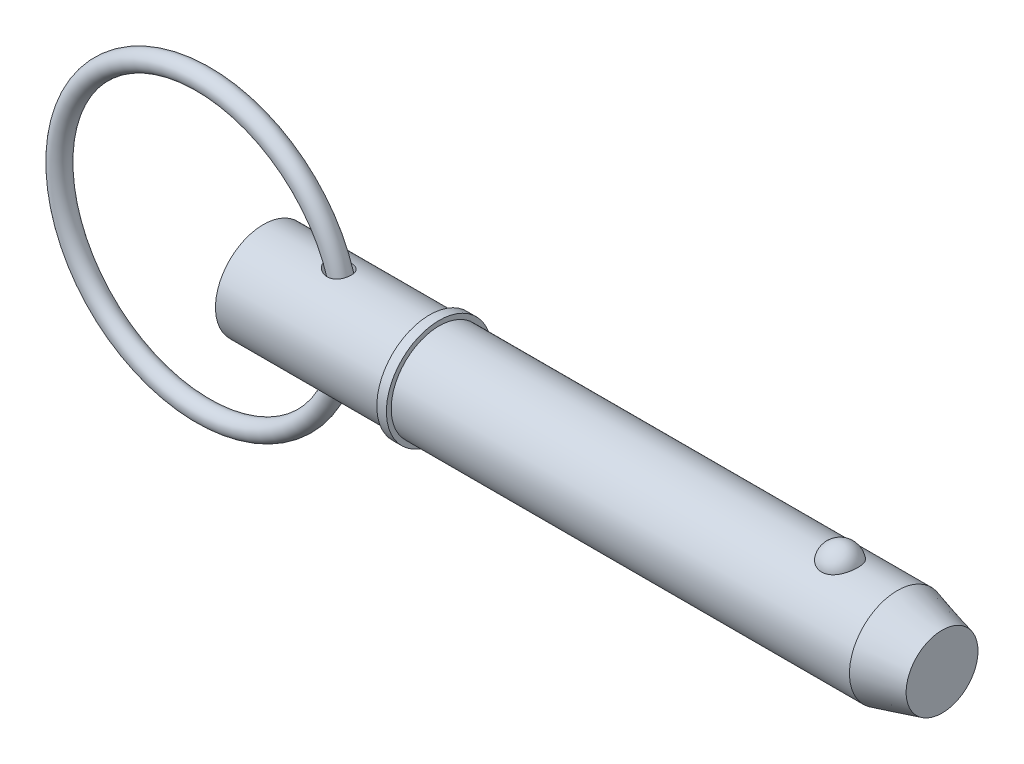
ISO-10303-21;
HEADER;
FILE_DESCRIPTION(('STEP AP214'),'2;1');
FILE_NAME('part.step','',(''),(''),'','','');
FILE_SCHEMA(('AUTOMOTIVE_DESIGN { 1 0 10303 214 1 1 1 1 }'));
ENDSEC;
DATA;
#1=APPLICATION_CONTEXT('core data for automotive mechanical design processes');
#2=APPLICATION_PROTOCOL_DEFINITION('international standard','automotive_design',2000,#1);
#3=PRODUCT_CONTEXT('',#1,'mechanical');
#4=PRODUCT('Part','Part','',(#3));
#5=PRODUCT_RELATED_PRODUCT_CATEGORY('part','',(#4));
#6=PRODUCT_DEFINITION_FORMATION('','',#4);
#7=PRODUCT_DEFINITION_CONTEXT('part definition',#1,'design');
#8=PRODUCT_DEFINITION('design','',#6,#7);
#9=PRODUCT_DEFINITION_SHAPE('','',#8);
#10=(LENGTH_UNIT() NAMED_UNIT(*) SI_UNIT(.MILLI.,.METRE.));
#11=(NAMED_UNIT(*) PLANE_ANGLE_UNIT() SI_UNIT($,.RADIAN.));
#12=(NAMED_UNIT(*) SI_UNIT($,.STERADIAN.) SOLID_ANGLE_UNIT());
#13=UNCERTAINTY_MEASURE_WITH_UNIT(LENGTH_MEASURE(1.E-05),#10,'distance_accuracy_value','');
#14=(GEOMETRIC_REPRESENTATION_CONTEXT(3) GLOBAL_UNCERTAINTY_ASSIGNED_CONTEXT((#13)) GLOBAL_UNIT_ASSIGNED_CONTEXT((#10,
#11,#12)) REPRESENTATION_CONTEXT('',''));
#15=CARTESIAN_POINT('',(0.,0.,0.));
#16=DIRECTION('',(0.,0.,1.));
#17=DIRECTION('',(1.,0.,0.));
#18=AXIS2_PLACEMENT_3D('',#15,#16,#17);
#19=CARTESIAN_POINT('',(-11.9894358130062,0.,0.));
#20=DIRECTION('',(0.,0.,1.));
#21=DIRECTION('',(1.,0.,0.));
#22=AXIS2_PLACEMENT_3D('',#19,#20,#21);
#23=TOROIDAL_SURFACE('',#22,28.575,1.905);
#24=CARTESIAN_POINT('',(18.4905641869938,0.,0.));
#25=VERTEX_POINT('',#24);
#26=VERTEX_LOOP('',#25);
#27=FACE_BOUND('',#26,.T.);
#28=ADVANCED_FACE('P0_F12',(#27),#23,.T.);
#29=CLOSED_SHELL('',(#28));
#30=MANIFOLD_SOLID_BREP('P0_B1',#29);
#31=CARTESIAN_POINT('',(0.,0.,0.));
#32=DIRECTION('',(1.,0.,0.));
#33=DIRECTION('',(0.,0.,-1.));
#34=AXIS2_PLACEMENT_3D('',#31,#32,#33);
#35=CYLINDRICAL_SURFACE('',#34,9.525);
#36=CARTESIAN_POINT('',(12.9513882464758,9.41921920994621,-1.41559473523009));
#37=CARTESIAN_POINT('',(13.0504692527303,9.40163924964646,-1.53256769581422));
#38=CARTESIAN_POINT('',(13.1602600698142,9.38319823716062,-1.6404459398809));
#39=CARTESIAN_POINT('',(13.3966485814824,9.34687220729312,-1.83618480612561));
#40=CARTESIAN_POINT('',(13.5232761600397,9.32898824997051,-1.92400906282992));
#41=CARTESIAN_POINT('',(13.78900694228,9.29593183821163,-2.07784697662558));
#42=CARTESIAN_POINT('',(13.9280753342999,9.28075215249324,-2.14391921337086));
#43=CARTESIAN_POINT('',(14.2153444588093,9.25488828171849,-2.25295850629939));
#44=CARTESIAN_POINT('',(14.3635415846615,9.24420233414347,-2.29593462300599));
#45=CARTESIAN_POINT('',(14.669669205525,9.22859713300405,-2.3579005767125));
#46=CARTESIAN_POINT('',(14.8277567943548,9.22385123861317,-2.37617053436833));
#47=CARTESIAN_POINT('',(15.1447573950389,9.22170813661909,-2.38448481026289));
#48=CARTESIAN_POINT('',(15.3036699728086,9.22430739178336,-2.3745427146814));
#49=CARTESIAN_POINT('',(15.6046561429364,9.2363636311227,-2.32717331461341));
#50=CARTESIAN_POINT('',(15.7470893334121,9.24528216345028,-2.29190131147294));
#51=CARTESIAN_POINT('',(16.0228763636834,9.26842607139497,-2.19642882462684));
#52=CARTESIAN_POINT('',(16.1562346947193,9.28264879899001,-2.1362407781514));
#53=CARTESIAN_POINT('',(16.3991522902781,9.31332263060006,-1.99805318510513));
#54=CARTESIAN_POINT('',(16.5097585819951,9.32951023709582,-1.92182839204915));
#55=CARTESIAN_POINT('',(16.7159974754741,9.36298467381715,-1.75147176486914));
#56=CARTESIAN_POINT('',(16.811631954,9.38027136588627,-1.65734217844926));
#57=CARTESIAN_POINT('',(16.9833240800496,9.41356881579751,-1.45618916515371));
#58=CARTESIAN_POINT('',(17.0597719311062,9.42959946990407,-1.34950141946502));
#59=CARTESIAN_POINT('',(17.1939538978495,9.45905380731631,-1.12462011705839));
#60=CARTESIAN_POINT('',(17.2516877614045,9.4724774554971,-1.00642640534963));
#61=CARTESIAN_POINT('',(17.3474400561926,9.49535683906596,-0.760990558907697));
#62=CARTESIAN_POINT('',(17.3853184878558,9.50478431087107,-0.633691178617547));
#63=CARTESIAN_POINT('',(17.4399027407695,9.51852575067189,-0.374363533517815));
#64=CARTESIAN_POINT('',(17.4566077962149,9.52283953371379,-0.242335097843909));
#65=CARTESIAN_POINT('',(17.4685150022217,9.52590431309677,0.0235692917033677));
#66=CARTESIAN_POINT('',(17.4635842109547,9.52462091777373,0.157451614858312));
#67=CARTESIAN_POINT('',(17.4320243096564,9.5165501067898,0.422467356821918));
#68=CARTESIAN_POINT('',(17.4053947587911,9.50976257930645,0.55360071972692));
#69=CARTESIAN_POINT('',(17.3310009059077,9.49140797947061,0.809490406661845));
#70=CARTESIAN_POINT('',(17.2832204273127,9.47983724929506,0.934241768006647));
#71=CARTESIAN_POINT('',(17.1676219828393,9.453180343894,1.1736825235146));
#72=CARTESIAN_POINT('',(17.0998044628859,9.43809424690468,1.28837214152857));
#73=CARTESIAN_POINT('',(16.9461013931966,9.40614962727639,1.50393386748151));
#74=CARTESIAN_POINT('',(16.8602910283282,9.38929862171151,1.6048606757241));
#75=CARTESIAN_POINT('',(16.6726759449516,9.35566510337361,1.79055313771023));
#76=CARTESIAN_POINT('',(16.5708731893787,9.33888258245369,1.87532077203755));
#77=CARTESIAN_POINT('',(16.3550631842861,9.30741331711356,2.02572386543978));
#78=CARTESIAN_POINT('',(16.2411701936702,9.29270956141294,2.09151983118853));
#79=CARTESIAN_POINT('',(16.0037488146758,9.26681293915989,2.20343355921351));
#80=CARTESIAN_POINT('',(15.8802207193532,9.25561996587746,2.24955191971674));
#81=CARTESIAN_POINT('',(15.6262451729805,9.23779438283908,2.32167613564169));
#82=CARTESIAN_POINT('',(15.4957570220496,9.23119272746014,2.34754561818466));
#83=CARTESIAN_POINT('',(15.2322153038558,9.22318493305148,2.37881082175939));
#84=CARTESIAN_POINT('',(15.0991611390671,9.22178001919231,2.38420171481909));
#85=CARTESIAN_POINT('',(14.8267609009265,9.22414647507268,2.37503099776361));
#86=CARTESIAN_POINT('',(14.6874545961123,9.22819578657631,2.35939810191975));
#87=CARTESIAN_POINT('',(14.412976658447,9.24129253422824,2.30756034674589));
#88=CARTESIAN_POINT('',(14.2778066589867,9.25034191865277,2.27134746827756));
#89=CARTESIAN_POINT('',(14.0027915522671,9.27334688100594,2.1756145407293));
#90=CARTESIAN_POINT('',(13.8635960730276,9.28766658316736,2.11431132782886));
#91=CARTESIAN_POINT('',(13.5969045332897,9.31925368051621,1.97041856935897));
#92=CARTESIAN_POINT('',(13.4694182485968,9.33652350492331,1.88781145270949));
#93=CARTESIAN_POINT('',(13.2243568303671,9.37286659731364,1.69844580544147));
#94=CARTESIAN_POINT('',(13.1075060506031,9.39198626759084,1.59075211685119));
#95=CARTESIAN_POINT('',(12.8957171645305,9.42881110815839,1.35544651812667));
#96=CARTESIAN_POINT('',(12.8007455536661,9.44651841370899,1.22786557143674));
#97=CARTESIAN_POINT('',(12.6580495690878,9.4741137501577,0.9887243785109));
#98=CARTESIAN_POINT('',(12.604453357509,9.4848570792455,0.880756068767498));
#99=CARTESIAN_POINT('',(12.515693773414,9.50295777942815,0.657225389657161));
#100=CARTESIAN_POINT('',(12.4805142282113,9.51031812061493,0.541669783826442));
#101=CARTESIAN_POINT('',(12.4305797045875,9.52083647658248,0.305475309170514));
#102=CARTESIAN_POINT('',(12.4159122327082,9.52397648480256,0.18481691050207));
#103=CARTESIAN_POINT('',(12.408320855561,9.52559626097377,-0.0572308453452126));
#104=CARTESIAN_POINT('',(12.4153963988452,9.52407614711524,-0.178620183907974));
#105=CARTESIAN_POINT('',(12.4495068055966,9.51684301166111,-0.409566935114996));
#106=CARTESIAN_POINT('',(12.4750931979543,9.51143444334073,-0.519353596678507));
#107=CARTESIAN_POINT('',(12.543120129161,9.49733710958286,-0.73328523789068));
#108=CARTESIAN_POINT('',(12.5855568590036,9.4886490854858,-0.837431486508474));
#109=CARTESIAN_POINT('',(12.6780792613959,9.47023833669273,-1.02356028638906));
#110=CARTESIAN_POINT('',(12.7261842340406,9.46084463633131,-1.10657511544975));
#111=CARTESIAN_POINT('',(12.8319313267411,9.44081892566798,-1.26610577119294));
#112=CARTESIAN_POINT('',(12.8895756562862,9.43018662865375,-1.34262008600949));
#113=CARTESIAN_POINT('',(12.9513882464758,9.41921920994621,-1.41559473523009));
#114=B_SPLINE_CURVE_WITH_KNOTS('',3,(#36,#37,#38,#39,#40,#41,#42,#43,#44,#45,#46,#47,#48,#49,
#50,#51,#52,#53,#54,#55,#56,#57,#58,#59,#60,#61,#62,#63,#64,#65,#66,#67,#68,#69,#70,#71,#72,#73,
#74,#75,#76,#77,#78,#79,#80,#81,#82,#83,#84,#85,#86,#87,#88,#89,#90,#91,#92,#93,#94,#95,#96,#97,
#98,#99,#100,#101,#102,#103,#104,#105,#106,#107,#108,#109,#110,#111,#112,#113),.UNSPECIFIED.,
.T.,.F.,(4,2,2,2,2,2,2,2,2,2,2,2,2,2,2,2,2,2,2,2,2,2,2,2,2,2,2,2,2,2,2,2,2,2,2,2,2,2,4),(0.,
0.462524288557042,0.925880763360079,1.3879789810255,1.8498957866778,2.3250010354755,
2.79987752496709,3.23851602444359,3.67693583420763,4.08084875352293,4.48471100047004,
4.87953549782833,5.27436531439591,5.67194282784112,6.0695347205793,6.46957303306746,
6.86961947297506,7.26997240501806,7.67031642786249,8.06901977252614,8.46767421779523,
8.86284969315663,9.25801315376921,9.65581560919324,10.0537118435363,10.4726706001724,
10.8917927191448,11.3481090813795,11.8048030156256,12.2824769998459,12.7594145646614,
13.1209614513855,13.4821903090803,13.8449555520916,14.2077115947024,14.5447865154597,
14.881785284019,15.170268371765,15.4588183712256),.UNSPECIFIED.);
#115=CARTESIAN_POINT('',(12.9513882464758,9.41921920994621,-1.41559473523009));
#116=VERTEX_POINT('',#115);
#117=EDGE_CURVE('P1_E42',#116,#116,#114,.T.);
#118=ORIENTED_EDGE('',*,*,#117,.T.);
#119=EDGE_LOOP('',(#118));
#120=FACE_BOUND('',#119,.T.);
#121=CARTESIAN_POINT('',(0.,0.,0.));
#122=DIRECTION('',(1.,0.,0.));
#123=DIRECTION('',(0.,0.,-1.));
#124=AXIS2_PLACEMENT_3D('',#121,#122,#123);
#125=CIRCLE('',#124,9.525);
#126=CARTESIAN_POINT('',(0.,0.,-9.525));
#127=VERTEX_POINT('',#126);
#128=EDGE_CURVE('P1_E9',#127,#127,#125,.T.);
#129=ORIENTED_EDGE('',*,*,#128,.T.);
#130=EDGE_LOOP('',(#129));
#131=FACE_BOUND('',#130,.T.);
#132=CARTESIAN_POINT('',(33.025,0.,0.));
#133=DIRECTION('',(1.,0.,0.));
#134=DIRECTION('',(0.,0.,-1.));
#135=AXIS2_PLACEMENT_3D('',#132,#133,#134);
#136=CIRCLE('',#135,9.525);
#137=CARTESIAN_POINT('',(33.025,0.,-9.525));
#138=VERTEX_POINT('',#137);
#139=EDGE_CURVE('P1_E25',#138,#138,#136,.T.);
#140=ORIENTED_EDGE('',*,*,#139,.F.);
#141=EDGE_LOOP('',(#140));
#142=FACE_BOUND('',#141,.T.);
#143=CARTESIAN_POINT('',(12.9513882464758,-9.41921920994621,-1.41559473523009));
#144=CARTESIAN_POINT('',(12.8706569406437,-9.43354320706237,-1.32028288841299));
#145=CARTESIAN_POINT('',(12.7970077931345,-9.44729974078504,-1.21890449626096));
#146=CARTESIAN_POINT('',(12.6667099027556,-9.47239055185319,-1.00546491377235));
#147=CARTESIAN_POINT('',(12.6100480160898,-9.48372669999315,-0.893412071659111));
#148=CARTESIAN_POINT('',(12.5163428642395,-9.50281544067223,-0.66020233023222));
#149=CARTESIAN_POINT('',(12.4794216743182,-9.51054569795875,-0.538993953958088));
#150=CARTESIAN_POINT('',(12.4282252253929,-9.52133525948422,-0.29167282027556));
#151=CARTESIAN_POINT('',(12.4139371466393,-9.52439720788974,-0.165562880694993));
#152=CARTESIAN_POINT('',(12.4092595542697,-9.52539668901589,0.0763263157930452));
#153=CARTESIAN_POINT('',(12.4169377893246,-9.5237485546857,0.192070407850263));
#154=CARTESIAN_POINT('',(12.4515961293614,-9.51640070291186,0.420478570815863));
#155=CARTESIAN_POINT('',(12.4785770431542,-9.51070081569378,0.533142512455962));
#156=CARTESIAN_POINT('',(12.5496371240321,-9.49599978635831,0.750537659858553));
#157=CARTESIAN_POINT('',(12.5934215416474,-9.48705569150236,0.855370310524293));
#158=CARTESIAN_POINT('',(12.6960201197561,-9.46670226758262,1.05710432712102));
#159=CARTESIAN_POINT('',(12.754838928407,-9.45529217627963,1.15400322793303));
#160=CARTESIAN_POINT('',(12.8926588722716,-9.42958102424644,1.34883014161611));
#161=CARTESIAN_POINT('',(12.9731843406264,-9.41509922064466,1.44565277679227));
#162=CARTESIAN_POINT('',(13.1473692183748,-9.38554264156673,1.62653953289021));
#163=CARTESIAN_POINT('',(13.2410364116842,-9.37046751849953,1.71059603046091));
#164=CARTESIAN_POINT('',(13.4543924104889,-9.33867330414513,1.87697964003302));
#165=CARTESIAN_POINT('',(13.5758667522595,-9.32205896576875,1.95704323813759));
#166=CARTESIAN_POINT('',(13.8299208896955,-9.29140277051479,2.09777392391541));
#167=CARTESIAN_POINT('',(13.9625074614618,-9.27736250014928,2.15842906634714));
#168=CARTESIAN_POINT('',(14.2477938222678,-9.25234849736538,2.26337318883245));
#169=CARTESIAN_POINT('',(14.4012368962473,-9.2417532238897,2.30575283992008));
#170=CARTESIAN_POINT('',(14.7134258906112,-9.22706044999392,2.36387471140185));
#171=CARTESIAN_POINT('',(14.8721705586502,-9.22296142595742,2.37962317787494));
#172=CARTESIAN_POINT('',(15.1841930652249,-9.22219798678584,2.38258156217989));
#173=CARTESIAN_POINT('',(15.3374581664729,-9.22526675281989,2.37081567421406));
#174=CARTESIAN_POINT('',(15.6390558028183,-9.23821642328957,2.31984408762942));
#175=CARTESIAN_POINT('',(15.7873916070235,-9.24809271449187,2.28065697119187));
#176=CARTESIAN_POINT('',(16.0605055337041,-9.27231045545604,2.17997072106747));
#177=CARTESIAN_POINT('',(16.1861988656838,-9.28616347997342,2.12082794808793));
#178=CARTESIAN_POINT('',(16.4248737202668,-9.31689725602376,1.9814435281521));
#179=CARTESIAN_POINT('',(16.5378583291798,-9.33377726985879,1.90120701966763));
#180=CARTESIAN_POINT('',(16.7424913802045,-9.36766057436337,1.72629138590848));
#181=CARTESIAN_POINT('',(16.8349077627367,-9.38461836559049,1.63249912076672));
#182=CARTESIAN_POINT('',(17.0025959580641,-9.41752009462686,1.43052052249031));
#183=CARTESIAN_POINT('',(17.0778684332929,-9.43346407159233,1.32233474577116));
#184=CARTESIAN_POINT('',(17.2093311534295,-9.46256896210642,1.09477833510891));
#185=CARTESIAN_POINT('',(17.2655443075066,-9.47573320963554,0.975421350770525));
#186=CARTESIAN_POINT('',(17.3577240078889,-9.49788660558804,0.728764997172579));
#187=CARTESIAN_POINT('',(17.3936897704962,-9.5068755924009,0.601465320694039));
#188=CARTESIAN_POINT('',(17.4447894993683,-9.51977728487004,0.341392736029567));
#189=CARTESIAN_POINT('',(17.4597470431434,-9.52364698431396,0.208583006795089));
#190=CARTESIAN_POINT('',(17.467935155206,-9.52575588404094,-0.0577507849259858));
#191=CARTESIAN_POINT('',(17.4611651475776,-9.52399493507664,-0.191274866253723));
#192=CARTESIAN_POINT('',(17.4259933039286,-9.51501704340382,-0.455658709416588));
#193=CARTESIAN_POINT('',(17.3975278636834,-9.50778405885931,-0.586509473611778));
#194=CARTESIAN_POINT('',(17.3195245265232,-9.48862442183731,-0.841413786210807));
#195=CARTESIAN_POINT('',(17.2699864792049,-9.47669773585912,-0.965467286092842));
#196=CARTESIAN_POINT('',(17.1510794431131,-9.44947793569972,-1.20302860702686));
#197=CARTESIAN_POINT('',(17.0817421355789,-9.43419020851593,-1.31655289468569));
#198=CARTESIAN_POINT('',(16.9249035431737,-9.40193593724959,-1.52999797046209));
#199=CARTESIAN_POINT('',(16.8374037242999,-9.38496952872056,-1.62991985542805));
#200=CARTESIAN_POINT('',(16.6472525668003,-9.35139745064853,-1.81261591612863));
#201=CARTESIAN_POINT('',(16.544718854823,-9.33479003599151,-1.89551219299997));
#202=CARTESIAN_POINT('',(16.3268885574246,-9.30366076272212,-2.04284430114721));
#203=CARTESIAN_POINT('',(16.2115933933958,-9.28913867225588,-2.10728218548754));
#204=CARTESIAN_POINT('',(15.9721327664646,-9.26380878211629,-2.21598517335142));
#205=CARTESIAN_POINT('',(15.8480095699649,-9.25298455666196,-2.26033977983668));
#206=CARTESIAN_POINT('',(15.5939970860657,-9.23601616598,-2.32870721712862));
#207=CARTESIAN_POINT('',(15.4641070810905,-9.22987258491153,-2.35271750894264));
#208=CARTESIAN_POINT('',(15.1982340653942,-9.22261892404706,-2.38099747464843));
#209=CARTESIAN_POINT('',(15.0621840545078,-9.22166165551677,-2.38466791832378));
#210=CARTESIAN_POINT('',(14.7911713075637,-9.22504733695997,-2.37153091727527));
#211=CARTESIAN_POINT('',(14.6562088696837,-9.2293916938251,-2.35471803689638));
#212=CARTESIAN_POINT('',(14.3799999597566,-9.24325361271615,-2.29972931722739));
#213=CARTESIAN_POINT('',(14.2390842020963,-9.25314817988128,-2.2599897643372));
#214=CARTESIAN_POINT('',(13.9651910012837,-9.27709186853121,-2.15959208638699));
#215=CARTESIAN_POINT('',(13.8322212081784,-9.29114491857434,-2.09891417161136));
#216=CARTESIAN_POINT('',(13.5621642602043,-9.32369066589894,-1.94960068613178));
#217=CARTESIAN_POINT('',(13.4264724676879,-9.34251276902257,-1.85849626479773));
#218=CARTESIAN_POINT('',(13.1736579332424,-9.38095091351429,-1.6535412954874));
#219=CARTESIAN_POINT('',(13.0565182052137,-9.40056620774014,-1.53971177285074));
#220=CARTESIAN_POINT('',(12.9513882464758,-9.41921920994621,-1.41559473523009));
#221=B_SPLINE_CURVE_WITH_KNOTS('',3,(#143,#144,#145,#146,#147,#148,#149,#150,#151,#152,#153,
#154,#155,#156,#157,#158,#159,#160,#161,#162,#163,#164,#165,#166,#167,#168,#169,#170,#171,#172,
#173,#174,#175,#176,#177,#178,#179,#180,#181,#182,#183,#184,#185,#186,#187,#188,#189,#190,#191,
#192,#193,#194,#195,#196,#197,#198,#199,#200,#201,#202,#203,#204,#205,#206,#207,#208,#209,#210,
#211,#212,#213,#214,#215,#216,#217,#218,#219,#220),.UNSPECIFIED.,.T.,.F.,(4,2,2,2,2,2,2,2,2,2,2,
2,2,2,2,2,2,2,2,2,2,2,2,2,2,2,2,2,2,2,2,2,2,2,2,2,2,2,4),(0.,0.376746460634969,0.75320065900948,
1.13195666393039,1.51049805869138,1.85679105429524,2.20309856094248,2.54359033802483,
2.88418751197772,3.26301611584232,3.64207005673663,4.07954912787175,4.51729693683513,
4.99355673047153,5.46970480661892,5.92841231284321,6.38680927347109,6.80346940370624,
7.22002812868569,7.61642768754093,8.01281192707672,8.40871801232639,8.80463942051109,
9.20386620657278,9.60310357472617,10.0035159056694,10.4039310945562,10.8037091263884,
11.2034549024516,11.6002252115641,11.9969513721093,12.3918916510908,12.7868812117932,
13.1934480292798,13.6001227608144,14.038511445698,14.4773156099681,14.9683748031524,
15.4589817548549),.UNSPECIFIED.);
#222=CARTESIAN_POINT('',(12.9513882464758,-9.41921920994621,-1.41559473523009));
#223=VERTEX_POINT('',#222);
#224=EDGE_CURVE('P1_E17',#223,#223,#221,.T.);
#225=ORIENTED_EDGE('',*,*,#224,.T.);
#226=EDGE_LOOP('',(#225));
#227=FACE_BOUND('',#226,.T.);
#228=ADVANCED_FACE('P1_F13',(#120,#131,#142,#227),#35,.T.);
#229=CARTESIAN_POINT('',(0.,0.,0.));
#230=DIRECTION('',(1.,0.,0.));
#231=DIRECTION('',(0.,0.,-1.));
#232=AXIS2_PLACEMENT_3D('',#229,#230,#231);
#233=CYLINDRICAL_SURFACE('',#232,9.525);
#234=CARTESIAN_POINT('',(126.043054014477,0.,0.));
#235=DIRECTION('',(1.,0.,0.));
#236=DIRECTION('',(0.,0.,-1.));
#237=AXIS2_PLACEMENT_3D('',#234,#235,#236);
#238=CIRCLE('',#237,9.525);
#239=CARTESIAN_POINT('',(126.043054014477,0.,-9.525));
#240=VERTEX_POINT('',#239);
#241=EDGE_CURVE('P1_E99',#240,#240,#238,.T.);
#242=ORIENTED_EDGE('',*,*,#241,.F.);
#243=EDGE_LOOP('',(#242));
#244=FACE_BOUND('',#243,.T.);
#245=CARTESIAN_POINT('',(34.93,0.,0.));
#246=DIRECTION('',(1.,0.,0.));
#247=DIRECTION('',(0.,0.,-1.));
#248=AXIS2_PLACEMENT_3D('',#245,#246,#247);
#249=CIRCLE('',#248,9.525);
#250=CARTESIAN_POINT('',(34.93,0.,-9.525));
#251=VERTEX_POINT('',#250);
#252=EDGE_CURVE('P1_E96',#251,#251,#249,.T.);
#253=ORIENTED_EDGE('',*,*,#252,.T.);
#254=EDGE_LOOP('',(#253));
#255=FACE_BOUND('',#254,.T.);
#256=CARTESIAN_POINT('',(114.645757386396,8.80405803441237,3.63513233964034));
#257=CARTESIAN_POINT('',(114.551676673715,8.80405953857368,3.63513053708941));
#258=CARTESIAN_POINT('',(114.457561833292,8.80561325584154,3.63137461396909));
#259=CARTESIAN_POINT('',(114.270012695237,8.81177748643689,3.61638665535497));
#260=CARTESIAN_POINT('',(114.176578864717,8.81638992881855,3.60514990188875));
#261=CARTESIAN_POINT('',(113.897945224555,8.83467114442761,3.56024627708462));
#262=CARTESIAN_POINT('',(113.714691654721,8.85278327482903,3.5153862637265));
#263=CARTESIAN_POINT('',(113.359509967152,8.89871214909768,3.39742145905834));
#264=CARTESIAN_POINT('',(113.187553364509,8.92650327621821,3.32439116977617));
#265=CARTESIAN_POINT('',(112.858707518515,8.98874819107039,3.15220244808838));
#266=CARTESIAN_POINT('',(112.701811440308,9.02319893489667,3.05305594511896));
#267=CARTESIAN_POINT('',(112.402214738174,9.09629186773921,2.82797815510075));
#268=CARTESIAN_POINT('',(112.260060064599,9.13502685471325,2.70135138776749));
#269=CARTESIAN_POINT('',(111.998299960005,9.2118657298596,2.42641932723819));
#270=CARTESIAN_POINT('',(111.878701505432,9.2499694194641,2.27810735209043));
#271=CARTESIAN_POINT('',(111.659645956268,9.32341082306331,1.95652290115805));
#272=CARTESIAN_POINT('',(111.561317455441,9.35855090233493,1.78243511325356));
#273=CARTESIAN_POINT('',(111.393819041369,9.42045142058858,1.41937246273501));
#274=CARTESIAN_POINT('',(111.324651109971,9.44721128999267,1.23039658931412));
#275=CARTESIAN_POINT('',(111.216199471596,9.48990641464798,0.84037088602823));
#276=CARTESIAN_POINT('',(111.177288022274,9.50570658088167,0.639202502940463));
#277=CARTESIAN_POINT('',(111.131555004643,9.52433146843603,0.23266436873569));
#278=CARTESIAN_POINT('',(111.124732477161,9.52715657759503,0.0272947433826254));
#279=CARTESIAN_POINT('',(111.143255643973,9.51956918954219,-0.380478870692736));
#280=CARTESIAN_POINT('',(111.168405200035,9.50923740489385,-0.582893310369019));
#281=CARTESIAN_POINT('',(111.25002537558,9.47651897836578,-0.980293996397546));
#282=CARTESIAN_POINT('',(111.306496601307,9.45413210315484,-1.17528009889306));
#283=CARTESIAN_POINT('',(111.449719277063,9.39954044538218,-1.55263697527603));
#284=CARTESIAN_POINT('',(111.536512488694,9.36732213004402,-1.73498993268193));
#285=CARTESIAN_POINT('',(111.738610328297,9.29640700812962,-2.08177763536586));
#286=CARTESIAN_POINT('',(111.853917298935,9.25770966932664,-2.24621090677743));
#287=CARTESIAN_POINT('',(112.111264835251,9.17775604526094,-2.5533833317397));
#288=CARTESIAN_POINT('',(112.253434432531,9.136488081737,-2.696011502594));
#289=CARTESIAN_POINT('',(112.56089985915,9.05620497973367,-2.95451229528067));
#290=CARTESIAN_POINT('',(112.726193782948,9.01718965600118,-3.070387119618));
#291=CARTESIAN_POINT('',(113.072052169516,8.94680019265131,-3.26976836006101));
#292=CARTESIAN_POINT('',(113.252227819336,8.91528408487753,-3.353897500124));
#293=CARTESIAN_POINT('',(113.625651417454,8.86272514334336,-3.49043503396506));
#294=CARTESIAN_POINT('',(113.818894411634,8.84167836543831,-3.54285537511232));
#295=CARTESIAN_POINT('',(114.202503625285,8.81348056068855,-3.61241306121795));
#296=CARTESIAN_POINT('',(114.392525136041,8.80568348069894,-3.63119339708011));
#297=CARTESIAN_POINT('',(114.773190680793,8.80289410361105,-3.63795342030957));
#298=CARTESIAN_POINT('',(114.963834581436,8.80789922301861,-3.62593932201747));
#299=CARTESIAN_POINT('',(115.334007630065,8.82974915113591,-3.57238430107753));
#300=CARTESIAN_POINT('',(115.513697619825,8.84621463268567,-3.53178890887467));
#301=CARTESIAN_POINT('',(115.863422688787,8.88875330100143,-3.42331083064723));
#302=CARTESIAN_POINT('',(116.033456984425,8.91482726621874,-3.35542593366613));
#303=CARTESIAN_POINT('',(116.363237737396,8.97448239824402,-3.19248225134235));
#304=CARTESIAN_POINT('',(116.522680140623,9.00821446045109,-3.0968647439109));
#305=CARTESIAN_POINT('',(116.823513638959,9.07935398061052,-2.88162736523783));
#306=CARTESIAN_POINT('',(116.964900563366,9.11676228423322,-2.76200196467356));
#307=CARTESIAN_POINT('',(117.23331931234,9.19347419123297,-2.49516285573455));
#308=CARTESIAN_POINT('',(117.359275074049,9.23277872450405,-2.34686614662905));
#309=CARTESIAN_POINT('',(117.585522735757,9.3073761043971,-2.0309368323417));
#310=CARTESIAN_POINT('',(117.68581004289,9.34266823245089,-1.86330077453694));
#311=CARTESIAN_POINT('',(117.861514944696,9.40674710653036,-1.50744893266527));
#312=CARTESIAN_POINT('',(117.936041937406,9.43529176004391,-1.31874876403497));
#313=CARTESIAN_POINT('',(118.05416505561,9.48144132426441,-0.930631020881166));
#314=CARTESIAN_POINT('',(118.097760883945,9.49904612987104,-0.73121334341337));
#315=CARTESIAN_POINT('',(118.153158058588,9.5215314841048,-0.327147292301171));
#316=CARTESIAN_POINT('',(118.164935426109,9.52640243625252,-0.12249509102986));
#317=CARTESIAN_POINT('',(118.156382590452,9.5228957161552,0.286018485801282));
#318=CARTESIAN_POINT('',(118.13605305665,9.5145183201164,0.489879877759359));
#319=CARTESIAN_POINT('',(118.063884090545,9.48544083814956,0.889994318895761));
#320=CARTESIAN_POINT('',(118.012199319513,9.46480124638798,1.08627971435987));
#321=CARTESIAN_POINT('',(117.878491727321,9.41333895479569,1.46682086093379));
#322=CARTESIAN_POINT('',(117.796466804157,9.38251554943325,1.65107577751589));
#323=CARTESIAN_POINT('',(117.60319292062,9.31365636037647,2.00346348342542));
#324=CARTESIAN_POINT('',(117.491783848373,9.27558138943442,2.17150083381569));
#325=CARTESIAN_POINT('',(117.242294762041,9.19638714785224,2.48563115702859));
#326=CARTESIAN_POINT('',(117.104216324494,9.15526805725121,2.63172542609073));
#327=CARTESIAN_POINT('',(116.804843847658,9.07465393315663,2.89750997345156));
#328=CARTESIAN_POINT('',(116.643610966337,9.03515496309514,3.01726776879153));
#329=CARTESIAN_POINT('',(116.301613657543,8.96227564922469,3.22732920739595));
#330=CARTESIAN_POINT('',(116.120841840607,8.92889763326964,3.31762165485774));
#331=CARTESIAN_POINT('',(115.751445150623,8.8734538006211,3.46314419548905));
#332=CARTESIAN_POINT('',(115.56332371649,8.85102983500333,3.51950082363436));
#333=CARTESIAN_POINT('',(115.27578699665,8.8266696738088,3.57993683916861));
#334=CARTESIAN_POINT('',(115.179133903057,8.82009725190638,3.5960621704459));
#335=CARTESIAN_POINT('',(114.984677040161,8.81020897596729,3.62022512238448));
#336=CARTESIAN_POINT('',(114.88687410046,8.80689090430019,3.62826825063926));
#337=CARTESIAN_POINT('',(114.741224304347,8.80445615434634,3.63416760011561));
#338=CARTESIAN_POINT('',(114.693495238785,8.80405727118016,3.63513325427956));
#339=CARTESIAN_POINT('',(114.645757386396,8.80405803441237,3.63513233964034));
#340=B_SPLINE_CURVE_WITH_KNOTS('',3,(#256,#257,#258,#259,#260,#261,#262,#263,#264,#265,#266,
#267,#268,#269,#270,#271,#272,#273,#274,#275,#276,#277,#278,#279,#280,#281,#282,#283,#284,#285,
#286,#287,#288,#289,#290,#291,#292,#293,#294,#295,#296,#297,#298,#299,#300,#301,#302,#303,#304,
#305,#306,#307,#308,#309,#310,#311,#312,#313,#314,#315,#316,#317,#318,#319,#320,#321,#322,#323,
#324,#325,#326,#327,#328,#329,#330,#331,#332,#333,#334,#335,#336,#337,#338,#339),.UNSPECIFIED.,
.T.,.F.,(4,2,2,2,2,2,2,2,2,2,2,2,2,2,2,2,2,2,2,2,2,2,2,2,2,2,2,2,2,2,2,2,2,2,2,2,2,2,2,2,2,4),
(0.,0.282202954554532,0.564584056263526,1.13017050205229,1.69427128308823,2.25811483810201,
2.83836627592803,3.4187968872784,4.02497117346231,4.63118665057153,5.24474754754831,
5.85829010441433,6.46808687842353,7.07789545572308,7.68854723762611,8.29924920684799,
8.9129628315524,9.52662591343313,10.1275338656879,10.7282152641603,11.2986646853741,
11.8689989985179,12.4213015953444,12.973648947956,13.5380053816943,14.1024919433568,
14.695298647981,15.2882113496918,15.8999469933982,16.5116885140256,17.1238909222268,
17.7360805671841,18.3452748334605,18.9545113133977,19.567138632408,20.179729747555,
20.7907316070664,21.4019653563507,21.9915938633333,22.2859053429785,22.5800161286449,
22.7232098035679),.UNSPECIFIED.);
#341=CARTESIAN_POINT('',(114.645757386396,8.80405803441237,3.63513233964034));
#342=VERTEX_POINT('',#341);
#343=EDGE_CURVE('P1_E34',#342,#342,#340,.T.);
#344=ORIENTED_EDGE('',*,*,#343,.T.);
#345=EDGE_LOOP('',(#344));
#346=FACE_BOUND('',#345,.T.);
#347=ADVANCED_FACE('P1_F46',(#244,#255,#346),#233,.T.);
#348=CARTESIAN_POINT('',(0.,0.,0.));
#349=DIRECTION('',(-1.,0.,0.));
#350=DIRECTION('',(0.,0.,1.));
#351=AXIS2_PLACEMENT_3D('',#348,#349,#350);
#352=PLANE('',#351);
#353=ORIENTED_EDGE('',*,*,#128,.F.);
#354=EDGE_LOOP('',(#353));
#355=FACE_BOUND('',#354,.T.);
#356=ADVANCED_FACE('P1_F15',(#355),#352,.T.);
#357=CARTESIAN_POINT('',(33.025,9.525,0.));
#358=DIRECTION('',(-1.,0.,0.));
#359=DIRECTION('',(0.,0.,1.));
#360=AXIS2_PLACEMENT_3D('',#357,#358,#359);
#361=PLANE('',#360);
#362=ORIENTED_EDGE('',*,*,#139,.T.);
#363=EDGE_LOOP('',(#362));
#364=FACE_BOUND('',#363,.T.);
#365=CARTESIAN_POINT('',(33.025,0.,0.));
#366=DIRECTION('',(1.,0.,0.));
#367=DIRECTION('',(0.,0.,-1.));
#368=AXIS2_PLACEMENT_3D('',#365,#366,#367);
#369=CIRCLE('',#368,10.4775);
#370=CARTESIAN_POINT('',(33.025,0.,-10.4775));
#371=VERTEX_POINT('',#370);
#372=EDGE_CURVE('P1_E30',#371,#371,#369,.T.);
#373=ORIENTED_EDGE('',*,*,#372,.F.);
#374=EDGE_LOOP('',(#373));
#375=FACE_BOUND('',#374,.T.);
#376=ADVANCED_FACE('P1_F81',(#364,#375),#361,.T.);
#377=CARTESIAN_POINT('',(0.,0.,0.));
#378=DIRECTION('',(1.,0.,0.));
#379=DIRECTION('',(0.,0.,-1.));
#380=AXIS2_PLACEMENT_3D('',#377,#378,#379);
#381=CYLINDRICAL_SURFACE('',#380,10.4775);
#382=ORIENTED_EDGE('',*,*,#372,.T.);
#383=EDGE_LOOP('',(#382));
#384=FACE_BOUND('',#383,.T.);
#385=CARTESIAN_POINT('',(34.93,0.,0.));
#386=DIRECTION('',(1.,0.,0.));
#387=DIRECTION('',(0.,0.,-1.));
#388=AXIS2_PLACEMENT_3D('',#385,#386,#387);
#389=CIRCLE('',#388,10.4775);
#390=CARTESIAN_POINT('',(34.93,0.,-10.4775));
#391=VERTEX_POINT('',#390);
#392=EDGE_CURVE('P1_E95',#391,#391,#389,.T.);
#393=ORIENTED_EDGE('',*,*,#392,.F.);
#394=EDGE_LOOP('',(#393));
#395=FACE_BOUND('',#394,.T.);
#396=ADVANCED_FACE('P1_F68',(#384,#395),#381,.T.);
#397=CARTESIAN_POINT('',(34.93,10.4775,0.));
#398=DIRECTION('',(1.,0.,0.));
#399=DIRECTION('',(0.,0.,-1.));
#400=AXIS2_PLACEMENT_3D('',#397,#398,#399);
#401=PLANE('',#400);
#402=ORIENTED_EDGE('',*,*,#392,.T.);
#403=EDGE_LOOP('',(#402));
#404=FACE_BOUND('',#403,.T.);
#405=ORIENTED_EDGE('',*,*,#252,.F.);
#406=EDGE_LOOP('',(#405));
#407=FACE_BOUND('',#406,.T.);
#408=ADVANCED_FACE('P1_F62',(#404,#407),#401,.T.);
#409=CARTESIAN_POINT('',(134.93,0.,0.));
#410=DIRECTION('',(-1.,0.,0.));
#411=DIRECTION('',(0.,0.,1.));
#412=AXIS2_PLACEMENT_3D('',#409,#410,#411);
#413=CONICAL_SURFACE('',#412,7.14375000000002,0.26179938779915);
#414=ORIENTED_EDGE('',*,*,#241,.T.);
#415=EDGE_LOOP('',(#414));
#416=FACE_BOUND('',#415,.T.);
#417=CARTESIAN_POINT('',(134.93,0.,0.));
#418=DIRECTION('',(1.,0.,0.));
#419=DIRECTION('',(0.,0.,-1.));
#420=AXIS2_PLACEMENT_3D('',#417,#418,#419);
#421=CIRCLE('',#420,7.14375000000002);
#422=CARTESIAN_POINT('',(134.93,0.,-7.14375000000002));
#423=VERTEX_POINT('',#422);
#424=EDGE_CURVE('P1_E41',#423,#423,#421,.T.);
#425=ORIENTED_EDGE('',*,*,#424,.F.);
#426=EDGE_LOOP('',(#425));
#427=FACE_BOUND('',#426,.T.);
#428=ADVANCED_FACE('P1_F59',(#416,#427),#413,.T.);
#429=CARTESIAN_POINT('',(134.93,7.14375000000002,0.));
#430=DIRECTION('',(1.,0.,0.));
#431=DIRECTION('',(0.,0.,-1.));
#432=AXIS2_PLACEMENT_3D('',#429,#430,#431);
#433=PLANE('',#432);
#434=ORIENTED_EDGE('',*,*,#424,.T.);
#435=EDGE_LOOP('',(#434));
#436=FACE_BOUND('',#435,.T.);
#437=ADVANCED_FACE('P1_F55',(#436),#433,.T.);
#438=CARTESIAN_POINT('',(114.645757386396,8.5725,0.));
#439=DIRECTION('',(-1.,0.,0.));
#440=DIRECTION('',(0.,-1.,0.));
#441=AXIS2_PLACEMENT_3D('',#438,#439,#440);
#442=SPHERICAL_SURFACE('',#441,3.64249999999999);
#443=ORIENTED_EDGE('',*,*,#343,.F.);
#444=EDGE_LOOP('',(#443));
#445=FACE_BOUND('',#444,.T.);
#446=ADVANCED_FACE('P1_F50',(#445),#442,.T.);
#447=CARTESIAN_POINT('',(-11.9894358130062,0.,0.));
#448=DIRECTION('',(0.,0.,1.));
#449=DIRECTION('',(1.,0.,0.));
#450=AXIS2_PLACEMENT_3D('',#447,#448,#449);
#451=TOROIDAL_SURFACE('',#450,28.575,2.38125);
#452=ORIENTED_EDGE('',*,*,#224,.F.);
#453=EDGE_LOOP('',(#452));
#454=FACE_BOUND('',#453,.T.);
#455=ORIENTED_EDGE('',*,*,#117,.F.);
#456=EDGE_LOOP('',(#455));
#457=FACE_BOUND('',#456,.T.);
#458=ADVANCED_FACE('P1_F54',(#454,#457),#451,.F.);
#459=CLOSED_SHELL('',(#228,#347,#356,#376,#396,#408,#428,#437,#446,#458));
#460=MANIFOLD_SOLID_BREP('P1_B1',#459);
#461=ADVANCED_BREP_SHAPE_REPRESENTATION('',(#18,#30,#460),#14);
#462=SHAPE_DEFINITION_REPRESENTATION(#9,#461);
ENDSEC;
END-ISO-10303-21;
